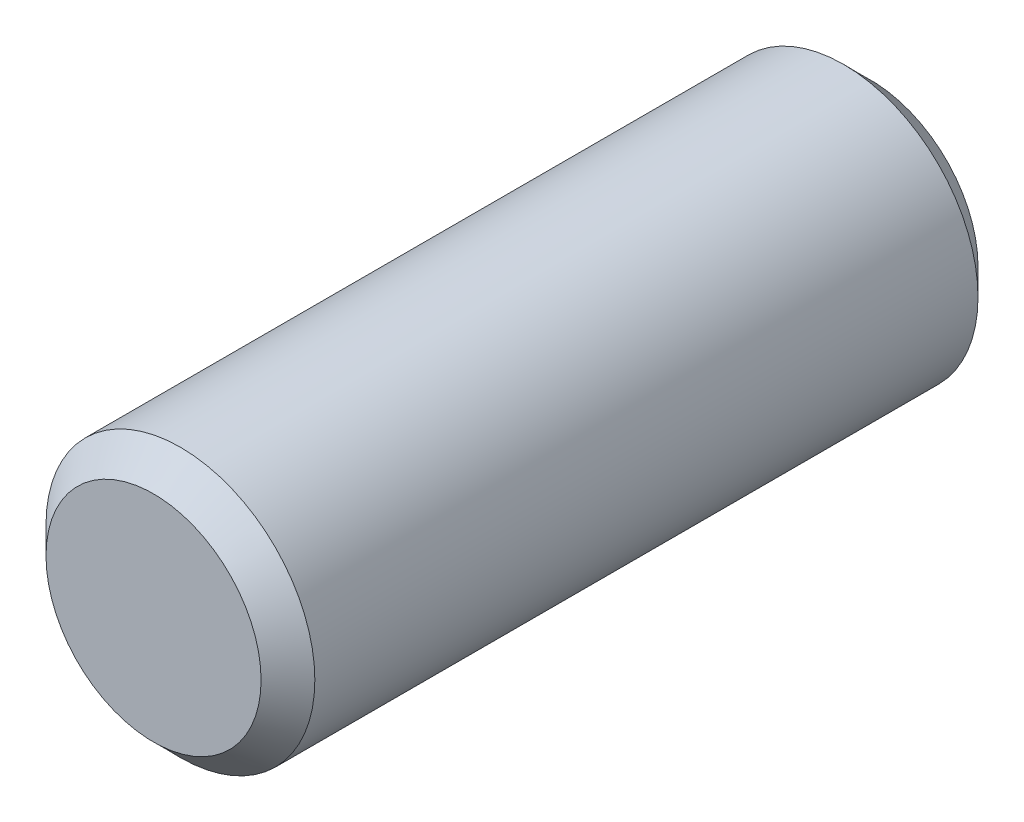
from build123d import *

# Parameters (mm, degrees)
ESQUISSE1_R             = 1.5
BOSS_EXTRU_1_DEPTH      = 8
CHANFREIN1_SIZE         = 0.3
ENL_V_MAT_EXTRU_1_DEPTH = 2


with BuildPart() as part:
    # Esquisse1 → Boss.-Extru.1 (new body)
    with BuildSketch(Plane.XY):
        Circle(ESQUISSE1_R)
    extrude(amount=BOSS_EXTRU_1_DEPTH)

    # Chanfrein1
    chanfrein1_edges = [part.edges().sort_by_distance(p)[0] for p in [
        (-1.5, 0, 0),
        (-1.5, 0, 8),
    ]]
    chamfer(chanfrein1_edges, length=CHANFREIN1_SIZE)

    # Esquisse2 → Enl_v. mat.-Extru.1 (cut)
    with BuildSketch(Plane(origin=(0, 0, 0), x_dir=(-1, 0, 0), z_dir=(0, 0, -1))):
        Polygon((1.154700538, 0), (0.577350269, 1), (-0.577350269, 1), (-1.154700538, 0), (-0.577350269, -1), (0.577350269, -1), align=None)
    extrude(amount=-ENL_V_MAT_EXTRU_1_DEPTH, mode=Mode.SUBTRACT)


solid = part.part
